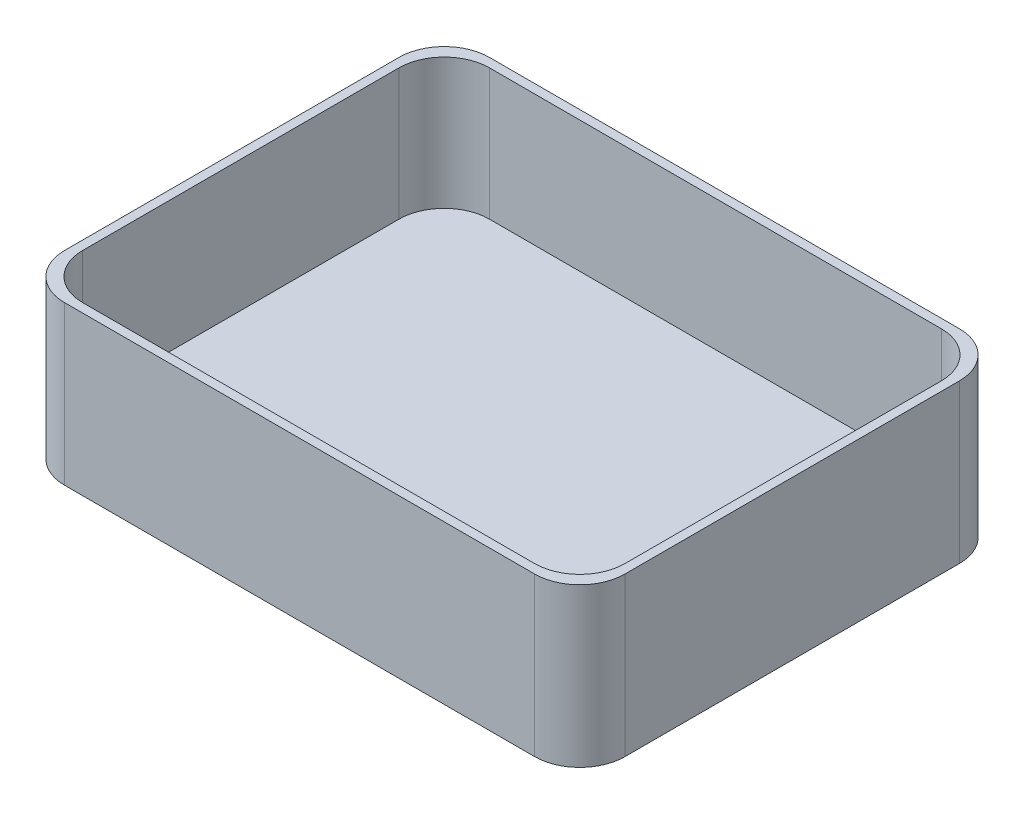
ISO-10303-21;
HEADER;
FILE_DESCRIPTION(('STEP AP214'),'2;1');
FILE_NAME('part.step','',(''),(''),'','','');
FILE_SCHEMA(('AUTOMOTIVE_DESIGN { 1 0 10303 214 1 1 1 1 }'));
ENDSEC;
DATA;
#1=APPLICATION_CONTEXT('core data for automotive mechanical design processes');
#2=APPLICATION_PROTOCOL_DEFINITION('international standard','automotive_design',2000,#1);
#3=PRODUCT_CONTEXT('',#1,'mechanical');
#4=PRODUCT('Part','Part','',(#3));
#5=PRODUCT_RELATED_PRODUCT_CATEGORY('part','',(#4));
#6=PRODUCT_DEFINITION_FORMATION('','',#4);
#7=PRODUCT_DEFINITION_CONTEXT('part definition',#1,'design');
#8=PRODUCT_DEFINITION('design','',#6,#7);
#9=PRODUCT_DEFINITION_SHAPE('','',#8);
#10=(LENGTH_UNIT() NAMED_UNIT(*) SI_UNIT(.MILLI.,.METRE.));
#11=(NAMED_UNIT(*) PLANE_ANGLE_UNIT() SI_UNIT($,.RADIAN.));
#12=(NAMED_UNIT(*) SI_UNIT($,.STERADIAN.) SOLID_ANGLE_UNIT());
#13=UNCERTAINTY_MEASURE_WITH_UNIT(LENGTH_MEASURE(1.E-05),#10,'distance_accuracy_value','');
#14=(GEOMETRIC_REPRESENTATION_CONTEXT(3) GLOBAL_UNCERTAINTY_ASSIGNED_CONTEXT((#13)) GLOBAL_UNIT_ASSIGNED_CONTEXT((#10,
#11,#12)) REPRESENTATION_CONTEXT('',''));
#15=CARTESIAN_POINT('',(0.,0.,0.));
#16=DIRECTION('',(0.,0.,1.));
#17=DIRECTION('',(1.,0.,0.));
#18=AXIS2_PLACEMENT_3D('',#15,#16,#17);
#19=CARTESIAN_POINT('',(62.,35.,-47.));
#20=DIRECTION('',(-1.,0.,0.));
#21=DIRECTION('',(0.,0.,1.));
#22=AXIS2_PLACEMENT_3D('',#19,#20,#21);
#23=PLANE('',#22);
#24=DIRECTION('',(0.,0.,-1.));
#25=VECTOR('',#24,1.);
#26=CARTESIAN_POINT('',(62.,0.,-47.));
#27=LINE('',#26,#25);
#28=CARTESIAN_POINT('',(62.,0.,37.));
#29=VERTEX_POINT('',#28);
#30=CARTESIAN_POINT('',(62.,0.,-37.));
#31=VERTEX_POINT('',#30);
#32=EDGE_CURVE('E217',#29,#31,#27,.T.);
#33=ORIENTED_EDGE('',*,*,#32,.T.);
#34=DIRECTION('',(0.,-1.,0.));
#35=VECTOR('',#34,1.);
#36=CARTESIAN_POINT('',(62.,35.,-37.));
#37=LINE('',#36,#35);
#38=CARTESIAN_POINT('',(62.,35.,-37.));
#39=VERTEX_POINT('',#38);
#40=EDGE_CURVE('E292',#31,#39,#37,.F.);
#41=ORIENTED_EDGE('',*,*,#40,.T.);
#42=DIRECTION('',(0.,0.,-1.));
#43=VECTOR('',#42,1.);
#44=CARTESIAN_POINT('',(62.,35.,-47.));
#45=LINE('',#44,#43);
#46=CARTESIAN_POINT('',(62.,35.,37.));
#47=VERTEX_POINT('',#46);
#48=EDGE_CURVE('E202',#47,#39,#45,.T.);
#49=ORIENTED_EDGE('',*,*,#48,.F.);
#50=DIRECTION('',(0.,-1.,0.));
#51=VECTOR('',#50,1.);
#52=CARTESIAN_POINT('',(62.,35.,37.));
#53=LINE('',#52,#51);
#54=EDGE_CURVE('E288',#47,#29,#53,.T.);
#55=ORIENTED_EDGE('',*,*,#54,.T.);
#56=EDGE_LOOP('',(#33,#41,#49,#55));
#57=FACE_BOUND('',#56,.T.);
#58=ADVANCED_FACE('F42',(#57),#23,.F.);
#59=CARTESIAN_POINT('',(-62.,35.,-47.));
#60=DIRECTION('',(0.,0.,1.));
#61=DIRECTION('',(1.,0.,0.));
#62=AXIS2_PLACEMENT_3D('',#59,#60,#61);
#63=PLANE('',#62);
#64=DIRECTION('',(-1.,0.,0.));
#65=VECTOR('',#64,1.);
#66=CARTESIAN_POINT('',(-62.,35.,-47.));
#67=LINE('',#66,#65);
#68=CARTESIAN_POINT('',(52.,35.,-47.));
#69=VERTEX_POINT('',#68);
#70=CARTESIAN_POINT('',(-52.,35.,-47.));
#71=VERTEX_POINT('',#70);
#72=EDGE_CURVE('E206',#69,#71,#67,.T.);
#73=ORIENTED_EDGE('',*,*,#72,.F.);
#74=DIRECTION('',(0.,-1.,0.));
#75=VECTOR('',#74,1.);
#76=CARTESIAN_POINT('',(52.,35.,-47.));
#77=LINE('',#76,#75);
#78=CARTESIAN_POINT('',(52.,0.,-47.));
#79=VERTEX_POINT('',#78);
#80=EDGE_CURVE('E272',#69,#79,#77,.T.);
#81=ORIENTED_EDGE('',*,*,#80,.T.);
#82=DIRECTION('',(-1.,0.,0.));
#83=VECTOR('',#82,1.);
#84=CARTESIAN_POINT('',(-62.,0.,-47.));
#85=LINE('',#84,#83);
#86=CARTESIAN_POINT('',(-52.,0.,-47.));
#87=VERTEX_POINT('',#86);
#88=EDGE_CURVE('E221',#79,#87,#85,.T.);
#89=ORIENTED_EDGE('',*,*,#88,.T.);
#90=DIRECTION('',(0.,-1.,0.));
#91=VECTOR('',#90,1.);
#92=CARTESIAN_POINT('',(-52.,35.,-47.));
#93=LINE('',#92,#91);
#94=EDGE_CURVE('E269',#87,#71,#93,.F.);
#95=ORIENTED_EDGE('',*,*,#94,.T.);
#96=EDGE_LOOP('',(#73,#81,#89,#95));
#97=FACE_BOUND('',#96,.T.);
#98=ADVANCED_FACE('F352',(#97),#63,.F.);
#99=CARTESIAN_POINT('',(-62.,35.,-47.));
#100=DIRECTION('',(1.,0.,0.));
#101=DIRECTION('',(0.,0.,-1.));
#102=AXIS2_PLACEMENT_3D('',#99,#100,#101);
#103=PLANE('',#102);
#104=DIRECTION('',(0.,0.,1.));
#105=VECTOR('',#104,1.);
#106=CARTESIAN_POINT('',(-62.,35.,-47.));
#107=LINE('',#106,#105);
#108=CARTESIAN_POINT('',(-62.,35.,-37.));
#109=VERTEX_POINT('',#108);
#110=CARTESIAN_POINT('',(-62.,35.,37.));
#111=VERTEX_POINT('',#110);
#112=EDGE_CURVE('E211',#109,#111,#107,.T.);
#113=ORIENTED_EDGE('',*,*,#112,.F.);
#114=DIRECTION('',(0.,-1.,0.));
#115=VECTOR('',#114,1.);
#116=CARTESIAN_POINT('',(-62.,35.,-37.));
#117=LINE('',#116,#115);
#118=CARTESIAN_POINT('',(-62.,0.,-37.));
#119=VERTEX_POINT('',#118);
#120=EDGE_CURVE('E309',#109,#119,#117,.T.);
#121=ORIENTED_EDGE('',*,*,#120,.T.);
#122=DIRECTION('',(0.,0.,1.));
#123=VECTOR('',#122,1.);
#124=CARTESIAN_POINT('',(-62.,0.,-47.));
#125=LINE('',#124,#123);
#126=CARTESIAN_POINT('',(-62.,0.,37.));
#127=VERTEX_POINT('',#126);
#128=EDGE_CURVE('E226',#119,#127,#125,.T.);
#129=ORIENTED_EDGE('',*,*,#128,.T.);
#130=DIRECTION('',(0.,-1.,0.));
#131=VECTOR('',#130,1.);
#132=CARTESIAN_POINT('',(-62.,35.,37.));
#133=LINE('',#132,#131);
#134=EDGE_CURVE('E306',#127,#111,#133,.F.);
#135=ORIENTED_EDGE('',*,*,#134,.T.);
#136=EDGE_LOOP('',(#113,#121,#129,#135));
#137=FACE_BOUND('',#136,.T.);
#138=ADVANCED_FACE('F358',(#137),#103,.F.);
#139=CARTESIAN_POINT('',(-62.,35.,47.));
#140=DIRECTION('',(0.,0.,-1.));
#141=DIRECTION('',(-1.,0.,0.));
#142=AXIS2_PLACEMENT_3D('',#139,#140,#141);
#143=PLANE('',#142);
#144=DIRECTION('',(1.,0.,0.));
#145=VECTOR('',#144,1.);
#146=CARTESIAN_POINT('',(-62.,35.,47.));
#147=LINE('',#146,#145);
#148=CARTESIAN_POINT('',(-52.,35.,47.));
#149=VERTEX_POINT('',#148);
#150=CARTESIAN_POINT('',(52.,35.,47.));
#151=VERTEX_POINT('',#150);
#152=EDGE_CURVE('E214',#149,#151,#147,.T.);
#153=ORIENTED_EDGE('',*,*,#152,.F.);
#154=DIRECTION('',(0.,-1.,0.));
#155=VECTOR('',#154,1.);
#156=CARTESIAN_POINT('',(-52.,35.,47.));
#157=LINE('',#156,#155);
#158=CARTESIAN_POINT('',(-52.,0.,47.));
#159=VERTEX_POINT('',#158);
#160=EDGE_CURVE('E11',#149,#159,#157,.T.);
#161=ORIENTED_EDGE('',*,*,#160,.T.);
#162=DIRECTION('',(1.,0.,0.));
#163=VECTOR('',#162,1.);
#164=CARTESIAN_POINT('',(-62.,0.,47.));
#165=LINE('',#164,#163);
#166=CARTESIAN_POINT('',(52.,0.,47.));
#167=VERTEX_POINT('',#166);
#168=EDGE_CURVE('E207',#159,#167,#165,.T.);
#169=ORIENTED_EDGE('',*,*,#168,.T.);
#170=DIRECTION('',(0.,-1.,0.));
#171=VECTOR('',#170,1.);
#172=CARTESIAN_POINT('',(52.,35.,47.));
#173=LINE('',#172,#171);
#174=EDGE_CURVE('E51',#167,#151,#173,.F.);
#175=ORIENTED_EDGE('',*,*,#174,.T.);
#176=EDGE_LOOP('',(#153,#161,#169,#175));
#177=FACE_BOUND('',#176,.T.);
#178=ADVANCED_FACE('F392',(#177),#143,.F.);
#179=CARTESIAN_POINT('',(0.,35.,0.));
#180=DIRECTION('',(0.,1.,0.));
#181=DIRECTION('',(0.,0.,1.));
#182=AXIS2_PLACEMENT_3D('',#179,#180,#181);
#183=PLANE('',#182);
#184=DIRECTION('',(0.,0.,-1.));
#185=VECTOR('',#184,1.);
#186=CARTESIAN_POINT('',(60.,35.,-45.));
#187=LINE('',#186,#185);
#188=CARTESIAN_POINT('',(60.,35.,35.));
#189=VERTEX_POINT('',#188);
#190=CARTESIAN_POINT('',(60.,35.,-35.));
#191=VERTEX_POINT('',#190);
#192=EDGE_CURVE('E198',#189,#191,#187,.T.);
#193=ORIENTED_EDGE('',*,*,#192,.F.);
#194=CARTESIAN_POINT('',(50.,35.,35.));
#195=DIRECTION('',(0.,1.,0.));
#196=DIRECTION('',(0.,0.,1.));
#197=AXIS2_PLACEMENT_3D('',#194,#195,#196);
#198=CIRCLE('',#197,10.);
#199=CARTESIAN_POINT('',(50.,35.,45.));
#200=VERTEX_POINT('',#199);
#201=EDGE_CURVE('E266',#189,#200,#198,.F.);
#202=ORIENTED_EDGE('',*,*,#201,.T.);
#203=DIRECTION('',(1.,0.,0.));
#204=VECTOR('',#203,1.);
#205=CARTESIAN_POINT('',(-60.,35.,45.));
#206=LINE('',#205,#204);
#207=CARTESIAN_POINT('',(-50.,35.,45.));
#208=VERTEX_POINT('',#207);
#209=EDGE_CURVE('E188',#208,#200,#206,.T.);
#210=ORIENTED_EDGE('',*,*,#209,.F.);
#211=CARTESIAN_POINT('',(-50.,35.,35.));
#212=DIRECTION('',(0.,1.,0.));
#213=DIRECTION('',(0.,0.,1.));
#214=AXIS2_PLACEMENT_3D('',#211,#212,#213);
#215=CIRCLE('',#214,10.);
#216=CARTESIAN_POINT('',(-60.,35.,35.));
#217=VERTEX_POINT('',#216);
#218=EDGE_CURVE('E186',#208,#217,#215,.F.);
#219=ORIENTED_EDGE('',*,*,#218,.T.);
#220=DIRECTION('',(0.,0.,1.));
#221=VECTOR('',#220,1.);
#222=CARTESIAN_POINT('',(-60.,35.,-45.));
#223=LINE('',#222,#221);
#224=CARTESIAN_POINT('',(-60.,35.,-35.));
#225=VERTEX_POINT('',#224);
#226=EDGE_CURVE('E175',#225,#217,#223,.T.);
#227=ORIENTED_EDGE('',*,*,#226,.F.);
#228=CARTESIAN_POINT('',(-50.,35.,-35.));
#229=DIRECTION('',(0.,1.,0.));
#230=DIRECTION('',(0.,0.,1.));
#231=AXIS2_PLACEMENT_3D('',#228,#229,#230);
#232=CIRCLE('',#231,10.);
#233=CARTESIAN_POINT('',(-50.,35.,-45.));
#234=VERTEX_POINT('',#233);
#235=EDGE_CURVE('E157',#225,#234,#232,.F.);
#236=ORIENTED_EDGE('',*,*,#235,.T.);
#237=DIRECTION('',(-1.,0.,0.));
#238=VECTOR('',#237,1.);
#239=CARTESIAN_POINT('',(-60.,35.,-45.));
#240=LINE('',#239,#238);
#241=CARTESIAN_POINT('',(50.,35.,-45.));
#242=VERTEX_POINT('',#241);
#243=EDGE_CURVE('E189',#242,#234,#240,.T.);
#244=ORIENTED_EDGE('',*,*,#243,.F.);
#245=CARTESIAN_POINT('',(50.,35.,-35.));
#246=DIRECTION('',(0.,1.,0.));
#247=DIRECTION('',(0.,0.,1.));
#248=AXIS2_PLACEMENT_3D('',#245,#246,#247);
#249=CIRCLE('',#248,10.);
#250=EDGE_CURVE('E168',#242,#191,#249,.F.);
#251=ORIENTED_EDGE('',*,*,#250,.T.);
#252=EDGE_LOOP('',(#193,#202,#210,#219,#227,#236,#244,#251));
#253=FACE_BOUND('',#252,.T.);
#254=ORIENTED_EDGE('',*,*,#48,.T.);
#255=CARTESIAN_POINT('',(52.,35.,-37.));
#256=DIRECTION('',(0.,1.,0.));
#257=DIRECTION('',(0.,0.,1.));
#258=AXIS2_PLACEMENT_3D('',#255,#256,#257);
#259=CIRCLE('',#258,10.);
#260=EDGE_CURVE('E303',#39,#69,#259,.T.);
#261=ORIENTED_EDGE('',*,*,#260,.T.);
#262=ORIENTED_EDGE('',*,*,#72,.T.);
#263=CARTESIAN_POINT('',(-52.,35.,-37.));
#264=DIRECTION('',(0.,1.,0.));
#265=DIRECTION('',(0.,0.,1.));
#266=AXIS2_PLACEMENT_3D('',#263,#264,#265);
#267=CIRCLE('',#266,10.);
#268=EDGE_CURVE('E300',#71,#109,#267,.T.);
#269=ORIENTED_EDGE('',*,*,#268,.T.);
#270=ORIENTED_EDGE('',*,*,#112,.T.);
#271=CARTESIAN_POINT('',(-52.,35.,37.));
#272=DIRECTION('',(0.,1.,0.));
#273=DIRECTION('',(0.,0.,1.));
#274=AXIS2_PLACEMENT_3D('',#271,#272,#273);
#275=CIRCLE('',#274,10.);
#276=EDGE_CURVE('E64',#111,#149,#275,.T.);
#277=ORIENTED_EDGE('',*,*,#276,.T.);
#278=ORIENTED_EDGE('',*,*,#152,.T.);
#279=CARTESIAN_POINT('',(52.,35.,37.));
#280=DIRECTION('',(0.,1.,0.));
#281=DIRECTION('',(0.,0.,1.));
#282=AXIS2_PLACEMENT_3D('',#279,#280,#281);
#283=CIRCLE('',#282,10.);
#284=EDGE_CURVE('E295',#151,#47,#283,.T.);
#285=ORIENTED_EDGE('',*,*,#284,.T.);
#286=EDGE_LOOP('',(#254,#261,#262,#269,#270,#277,#278,#285));
#287=FACE_BOUND('',#286,.T.);
#288=ADVANCED_FACE('F184',(#253,#287),#183,.T.);
#289=CARTESIAN_POINT('',(0.,0.,0.));
#290=DIRECTION('',(0.,1.,0.));
#291=DIRECTION('',(0.,0.,1.));
#292=AXIS2_PLACEMENT_3D('',#289,#290,#291);
#293=PLANE('',#292);
#294=ORIENTED_EDGE('',*,*,#88,.F.);
#295=CARTESIAN_POINT('',(52.,0.,-37.));
#296=DIRECTION('',(0.,1.,0.));
#297=DIRECTION('',(0.,0.,1.));
#298=AXIS2_PLACEMENT_3D('',#295,#296,#297);
#299=CIRCLE('',#298,10.);
#300=EDGE_CURVE('E285',#79,#31,#299,.F.);
#301=ORIENTED_EDGE('',*,*,#300,.T.);
#302=ORIENTED_EDGE('',*,*,#32,.F.);
#303=CARTESIAN_POINT('',(52.,0.,37.));
#304=DIRECTION('',(0.,1.,0.));
#305=DIRECTION('',(0.,0.,1.));
#306=AXIS2_PLACEMENT_3D('',#303,#304,#305);
#307=CIRCLE('',#306,10.);
#308=EDGE_CURVE('E276',#29,#167,#307,.F.);
#309=ORIENTED_EDGE('',*,*,#308,.T.);
#310=ORIENTED_EDGE('',*,*,#168,.F.);
#311=CARTESIAN_POINT('',(-52.,0.,37.));
#312=DIRECTION('',(0.,1.,0.));
#313=DIRECTION('',(0.,0.,1.));
#314=AXIS2_PLACEMENT_3D('',#311,#312,#313);
#315=CIRCLE('',#314,10.);
#316=EDGE_CURVE('E279',#159,#127,#315,.F.);
#317=ORIENTED_EDGE('',*,*,#316,.T.);
#318=ORIENTED_EDGE('',*,*,#128,.F.);
#319=CARTESIAN_POINT('',(-52.,0.,-37.));
#320=DIRECTION('',(0.,1.,0.));
#321=DIRECTION('',(0.,0.,1.));
#322=AXIS2_PLACEMENT_3D('',#319,#320,#321);
#323=CIRCLE('',#322,10.);
#324=EDGE_CURVE('E282',#119,#87,#323,.F.);
#325=ORIENTED_EDGE('',*,*,#324,.T.);
#326=EDGE_LOOP('',(#294,#301,#302,#309,#310,#317,#318,#325));
#327=FACE_BOUND('',#326,.T.);
#328=ADVANCED_FACE('F395',(#327),#293,.F.);
#329=CARTESIAN_POINT('',(60.,6.,-45.));
#330=DIRECTION('',(1.,0.,0.));
#331=DIRECTION('',(0.,0.,-1.));
#332=AXIS2_PLACEMENT_3D('',#329,#330,#331);
#333=PLANE('',#332);
#334=ORIENTED_EDGE('',*,*,#192,.T.);
#335=DIRECTION('',(0.,1.,0.));
#336=VECTOR('',#335,1.);
#337=CARTESIAN_POINT('',(60.,6.,-35.));
#338=LINE('',#337,#336);
#339=CARTESIAN_POINT('',(60.,6.,-35.));
#340=VERTEX_POINT('',#339);
#341=EDGE_CURVE('E253',#191,#340,#338,.F.);
#342=ORIENTED_EDGE('',*,*,#341,.T.);
#343=DIRECTION('',(0.,0.,-1.));
#344=VECTOR('',#343,1.);
#345=CARTESIAN_POINT('',(60.,6.,-45.));
#346=LINE('',#345,#344);
#347=CARTESIAN_POINT('',(60.,6.,35.));
#348=VERTEX_POINT('',#347);
#349=EDGE_CURVE('E195',#348,#340,#346,.T.);
#350=ORIENTED_EDGE('',*,*,#349,.F.);
#351=DIRECTION('',(0.,1.,0.));
#352=VECTOR('',#351,1.);
#353=CARTESIAN_POINT('',(60.,35.,35.));
#354=LINE('',#353,#352);
#355=EDGE_CURVE('E249',#348,#189,#354,.T.);
#356=ORIENTED_EDGE('',*,*,#355,.T.);
#357=EDGE_LOOP('',(#334,#342,#350,#356));
#358=FACE_BOUND('',#357,.T.);
#359=ADVANCED_FACE('F331',(#358),#333,.F.);
#360=CARTESIAN_POINT('',(-60.,6.,45.));
#361=DIRECTION('',(0.,0.,1.));
#362=DIRECTION('',(1.,0.,0.));
#363=AXIS2_PLACEMENT_3D('',#360,#361,#362);
#364=PLANE('',#363);
#365=DIRECTION('',(1.,0.,0.));
#366=VECTOR('',#365,1.);
#367=CARTESIAN_POINT('',(-60.,6.,45.));
#368=LINE('',#367,#366);
#369=CARTESIAN_POINT('',(-50.,6.,45.));
#370=VERTEX_POINT('',#369);
#371=CARTESIAN_POINT('',(50.,6.,45.));
#372=VERTEX_POINT('',#371);
#373=EDGE_CURVE('E222',#370,#372,#368,.T.);
#374=ORIENTED_EDGE('',*,*,#373,.F.);
#375=DIRECTION('',(0.,1.,0.));
#376=VECTOR('',#375,1.);
#377=CARTESIAN_POINT('',(-50.,35.,45.));
#378=LINE('',#377,#376);
#379=EDGE_CURVE('E169',#370,#208,#378,.T.);
#380=ORIENTED_EDGE('',*,*,#379,.T.);
#381=ORIENTED_EDGE('',*,*,#209,.T.);
#382=DIRECTION('',(0.,1.,0.));
#383=VECTOR('',#382,1.);
#384=CARTESIAN_POINT('',(50.,6.,45.));
#385=LINE('',#384,#383);
#386=EDGE_CURVE('E256',#200,#372,#385,.F.);
#387=ORIENTED_EDGE('',*,*,#386,.T.);
#388=EDGE_LOOP('',(#374,#380,#381,#387));
#389=FACE_BOUND('',#388,.T.);
#390=ADVANCED_FACE('F348',(#389),#364,.F.);
#391=CARTESIAN_POINT('',(-60.,6.,-45.));
#392=DIRECTION('',(-1.,0.,0.));
#393=DIRECTION('',(0.,0.,1.));
#394=AXIS2_PLACEMENT_3D('',#391,#392,#393);
#395=PLANE('',#394);
#396=DIRECTION('',(0.,0.,1.));
#397=VECTOR('',#396,1.);
#398=CARTESIAN_POINT('',(-60.,6.,-45.));
#399=LINE('',#398,#397);
#400=CARTESIAN_POINT('',(-60.,6.,-35.));
#401=VERTEX_POINT('',#400);
#402=CARTESIAN_POINT('',(-60.,6.,35.));
#403=VERTEX_POINT('',#402);
#404=EDGE_CURVE('E178',#401,#403,#399,.T.);
#405=ORIENTED_EDGE('',*,*,#404,.F.);
#406=DIRECTION('',(0.,1.,0.));
#407=VECTOR('',#406,1.);
#408=CARTESIAN_POINT('',(-60.,35.,-35.));
#409=LINE('',#408,#407);
#410=EDGE_CURVE('E161',#401,#225,#409,.T.);
#411=ORIENTED_EDGE('',*,*,#410,.T.);
#412=ORIENTED_EDGE('',*,*,#226,.T.);
#413=DIRECTION('',(0.,1.,0.));
#414=VECTOR('',#413,1.);
#415=CARTESIAN_POINT('',(-60.,6.,35.));
#416=LINE('',#415,#414);
#417=EDGE_CURVE('E181',#217,#403,#416,.F.);
#418=ORIENTED_EDGE('',*,*,#417,.T.);
#419=EDGE_LOOP('',(#405,#411,#412,#418));
#420=FACE_BOUND('',#419,.T.);
#421=ADVANCED_FACE('F174',(#420),#395,.F.);
#422=CARTESIAN_POINT('',(-60.,6.,-45.));
#423=DIRECTION('',(0.,0.,-1.));
#424=DIRECTION('',(-1.,0.,0.));
#425=AXIS2_PLACEMENT_3D('',#422,#423,#424);
#426=PLANE('',#425);
#427=ORIENTED_EDGE('',*,*,#243,.T.);
#428=DIRECTION('',(0.,1.,0.));
#429=VECTOR('',#428,1.);
#430=CARTESIAN_POINT('',(-50.,6.,-45.));
#431=LINE('',#430,#429);
#432=CARTESIAN_POINT('',(-50.,6.,-45.));
#433=VERTEX_POINT('',#432);
#434=EDGE_CURVE('E162',#234,#433,#431,.F.);
#435=ORIENTED_EDGE('',*,*,#434,.T.);
#436=DIRECTION('',(-1.,0.,0.));
#437=VECTOR('',#436,1.);
#438=CARTESIAN_POINT('',(-60.,6.,-45.));
#439=LINE('',#438,#437);
#440=CARTESIAN_POINT('',(50.,6.,-45.));
#441=VERTEX_POINT('',#440);
#442=EDGE_CURVE('E314',#441,#433,#439,.T.);
#443=ORIENTED_EDGE('',*,*,#442,.F.);
#444=DIRECTION('',(0.,1.,0.));
#445=VECTOR('',#444,1.);
#446=CARTESIAN_POINT('',(50.,35.,-45.));
#447=LINE('',#446,#445);
#448=EDGE_CURVE('E180',#441,#242,#447,.T.);
#449=ORIENTED_EDGE('',*,*,#448,.T.);
#450=EDGE_LOOP('',(#427,#435,#443,#449));
#451=FACE_BOUND('',#450,.T.);
#452=ADVANCED_FACE('F340',(#451),#426,.F.);
#453=CARTESIAN_POINT('',(0.,6.,0.));
#454=DIRECTION('',(0.,1.,0.));
#455=DIRECTION('',(0.,0.,1.));
#456=AXIS2_PLACEMENT_3D('',#453,#454,#455);
#457=PLANE('',#456);
#458=ORIENTED_EDGE('',*,*,#442,.T.);
#459=CARTESIAN_POINT('',(-50.,6.,-35.));
#460=DIRECTION('',(0.,1.,0.));
#461=DIRECTION('',(0.,0.,1.));
#462=AXIS2_PLACEMENT_3D('',#459,#460,#461);
#463=CIRCLE('',#462,10.);
#464=EDGE_CURVE('E246',#433,#401,#463,.T.);
#465=ORIENTED_EDGE('',*,*,#464,.T.);
#466=ORIENTED_EDGE('',*,*,#404,.T.);
#467=CARTESIAN_POINT('',(-50.,6.,35.));
#468=DIRECTION('',(0.,1.,0.));
#469=DIRECTION('',(0.,0.,1.));
#470=AXIS2_PLACEMENT_3D('',#467,#468,#469);
#471=CIRCLE('',#470,10.);
#472=EDGE_CURVE('E241',#403,#370,#471,.T.);
#473=ORIENTED_EDGE('',*,*,#472,.T.);
#474=ORIENTED_EDGE('',*,*,#373,.T.);
#475=CARTESIAN_POINT('',(50.,6.,35.));
#476=DIRECTION('',(0.,1.,0.));
#477=DIRECTION('',(0.,0.,1.));
#478=AXIS2_PLACEMENT_3D('',#475,#476,#477);
#479=CIRCLE('',#478,10.);
#480=EDGE_CURVE('E238',#372,#348,#479,.T.);
#481=ORIENTED_EDGE('',*,*,#480,.T.);
#482=ORIENTED_EDGE('',*,*,#349,.T.);
#483=CARTESIAN_POINT('',(50.,6.,-35.));
#484=DIRECTION('',(0.,1.,0.));
#485=DIRECTION('',(0.,0.,1.));
#486=AXIS2_PLACEMENT_3D('',#483,#484,#485);
#487=CIRCLE('',#486,10.);
#488=EDGE_CURVE('E243',#340,#441,#487,.T.);
#489=ORIENTED_EDGE('',*,*,#488,.T.);
#490=EDGE_LOOP('',(#458,#465,#466,#473,#474,#481,#482,#489));
#491=FACE_BOUND('',#490,.T.);
#492=ADVANCED_FACE('F338',(#491),#457,.T.);
#493=CARTESIAN_POINT('',(-50.,6.,-35.));
#494=DIRECTION('',(0.,-1.,0.));
#495=DIRECTION('',(0.,0.,-1.));
#496=AXIS2_PLACEMENT_3D('',#493,#494,#495);
#497=CYLINDRICAL_SURFACE('',#496,10.);
#498=ORIENTED_EDGE('',*,*,#464,.F.);
#499=ORIENTED_EDGE('',*,*,#434,.F.);
#500=ORIENTED_EDGE('',*,*,#235,.F.);
#501=ORIENTED_EDGE('',*,*,#410,.F.);
#502=EDGE_LOOP('',(#498,#499,#500,#501));
#503=FACE_BOUND('',#502,.T.);
#504=ADVANCED_FACE('F160',(#503),#497,.F.);
#505=CARTESIAN_POINT('',(50.,6.,-35.));
#506=DIRECTION('',(0.,-1.,0.));
#507=DIRECTION('',(0.,0.,-1.));
#508=AXIS2_PLACEMENT_3D('',#505,#506,#507);
#509=CYLINDRICAL_SURFACE('',#508,10.);
#510=ORIENTED_EDGE('',*,*,#488,.F.);
#511=ORIENTED_EDGE('',*,*,#341,.F.);
#512=ORIENTED_EDGE('',*,*,#250,.F.);
#513=ORIENTED_EDGE('',*,*,#448,.F.);
#514=EDGE_LOOP('',(#510,#511,#512,#513));
#515=FACE_BOUND('',#514,.T.);
#516=ADVANCED_FACE('F336',(#515),#509,.F.);
#517=CARTESIAN_POINT('',(-50.,6.,35.));
#518=DIRECTION('',(0.,-1.,0.));
#519=DIRECTION('',(0.,0.,-1.));
#520=AXIS2_PLACEMENT_3D('',#517,#518,#519);
#521=CYLINDRICAL_SURFACE('',#520,10.);
#522=ORIENTED_EDGE('',*,*,#472,.F.);
#523=ORIENTED_EDGE('',*,*,#417,.F.);
#524=ORIENTED_EDGE('',*,*,#218,.F.);
#525=ORIENTED_EDGE('',*,*,#379,.F.);
#526=EDGE_LOOP('',(#522,#523,#524,#525));
#527=FACE_BOUND('',#526,.T.);
#528=ADVANCED_FACE('F367',(#527),#521,.F.);
#529=CARTESIAN_POINT('',(50.,6.,35.));
#530=DIRECTION('',(0.,-1.,0.));
#531=DIRECTION('',(0.,0.,-1.));
#532=AXIS2_PLACEMENT_3D('',#529,#530,#531);
#533=CYLINDRICAL_SURFACE('',#532,10.);
#534=ORIENTED_EDGE('',*,*,#480,.F.);
#535=ORIENTED_EDGE('',*,*,#386,.F.);
#536=ORIENTED_EDGE('',*,*,#201,.F.);
#537=ORIENTED_EDGE('',*,*,#355,.F.);
#538=EDGE_LOOP('',(#534,#535,#536,#537));
#539=FACE_BOUND('',#538,.T.);
#540=ADVANCED_FACE('F370',(#539),#533,.F.);
#541=CARTESIAN_POINT('',(52.,35.,-37.));
#542=DIRECTION('',(0.,-1.,0.));
#543=DIRECTION('',(0.,0.,-1.));
#544=AXIS2_PLACEMENT_3D('',#541,#542,#543);
#545=CYLINDRICAL_SURFACE('',#544,10.);
#546=ORIENTED_EDGE('',*,*,#260,.F.);
#547=ORIENTED_EDGE('',*,*,#40,.F.);
#548=ORIENTED_EDGE('',*,*,#300,.F.);
#549=ORIENTED_EDGE('',*,*,#80,.F.);
#550=EDGE_LOOP('',(#546,#547,#548,#549));
#551=FACE_BOUND('',#550,.T.);
#552=ADVANCED_FACE('F374',(#551),#545,.T.);
#553=CARTESIAN_POINT('',(-52.,35.,-37.));
#554=DIRECTION('',(0.,-1.,0.));
#555=DIRECTION('',(0.,0.,-1.));
#556=AXIS2_PLACEMENT_3D('',#553,#554,#555);
#557=CYLINDRICAL_SURFACE('',#556,10.);
#558=ORIENTED_EDGE('',*,*,#268,.F.);
#559=ORIENTED_EDGE('',*,*,#94,.F.);
#560=ORIENTED_EDGE('',*,*,#324,.F.);
#561=ORIENTED_EDGE('',*,*,#120,.F.);
#562=EDGE_LOOP('',(#558,#559,#560,#561));
#563=FACE_BOUND('',#562,.T.);
#564=ADVANCED_FACE('F378',(#563),#557,.T.);
#565=CARTESIAN_POINT('',(-52.,35.,37.));
#566=DIRECTION('',(0.,-1.,0.));
#567=DIRECTION('',(0.,0.,-1.));
#568=AXIS2_PLACEMENT_3D('',#565,#566,#567);
#569=CYLINDRICAL_SURFACE('',#568,10.);
#570=ORIENTED_EDGE('',*,*,#276,.F.);
#571=ORIENTED_EDGE('',*,*,#134,.F.);
#572=ORIENTED_EDGE('',*,*,#316,.F.);
#573=ORIENTED_EDGE('',*,*,#160,.F.);
#574=EDGE_LOOP('',(#570,#571,#572,#573));
#575=FACE_BOUND('',#574,.T.);
#576=ADVANCED_FACE('F381',(#575),#569,.T.);
#577=CARTESIAN_POINT('',(52.,35.,37.));
#578=DIRECTION('',(0.,-1.,0.));
#579=DIRECTION('',(0.,0.,-1.));
#580=AXIS2_PLACEMENT_3D('',#577,#578,#579);
#581=CYLINDRICAL_SURFACE('',#580,10.);
#582=ORIENTED_EDGE('',*,*,#284,.F.);
#583=ORIENTED_EDGE('',*,*,#174,.F.);
#584=ORIENTED_EDGE('',*,*,#308,.F.);
#585=ORIENTED_EDGE('',*,*,#54,.F.);
#586=EDGE_LOOP('',(#582,#583,#584,#585));
#587=FACE_BOUND('',#586,.T.);
#588=ADVANCED_FACE('F44',(#587),#581,.T.);
#589=CLOSED_SHELL('',(#58,#98,#138,#178,#288,#328,#359,#390,#421,#452,#492,#504,#516,#528,#540,
#552,#564,#576,#588));
#590=MANIFOLD_SOLID_BREP('B2',#589);
#591=ADVANCED_BREP_SHAPE_REPRESENTATION('',(#18,#590),#14);
#592=SHAPE_DEFINITION_REPRESENTATION(#9,#591);
ENDSEC;
END-ISO-10303-21;
